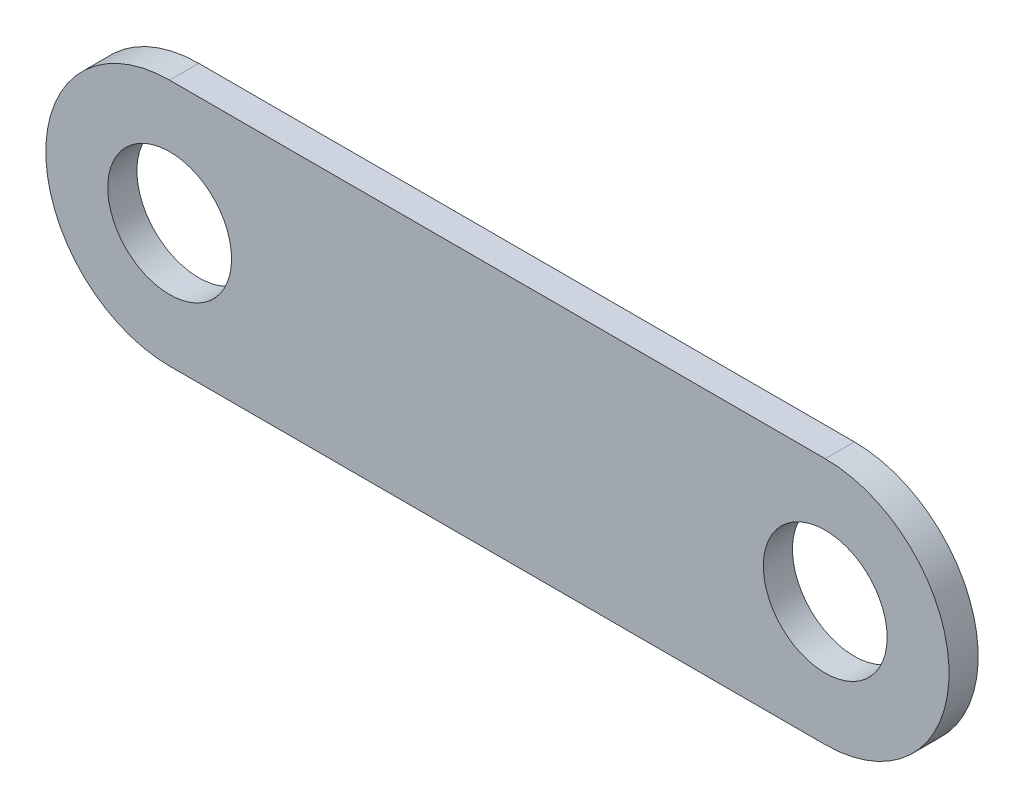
from build123d import *

# Parameters (mm, degrees)
SKETCH1_R           = 4.25
BOSS_EXTRUDE1_DEPTH = 2


with BuildPart() as part:
    # Sketch1 → Boss-Extrude1 (new body)
    with BuildSketch(Plane.XY):
        with BuildLine():
            Line((0, 8.5), (45, 8.5))
            ThreePointArc((45, 8.5), (53.5, 0), (45, -8.5))
            Line((45, -8.5), (0, -8.5))
            ThreePointArc((0, -8.5), (-8.5, 0), (0, 8.5))
        make_face()
        Circle(SKETCH1_R, mode=Mode.SUBTRACT)
        with Locations((45, 0)):
            Circle(SKETCH1_R, mode=Mode.SUBTRACT)
    extrude(amount=-BOSS_EXTRUDE1_DEPTH)


solid = part.part
